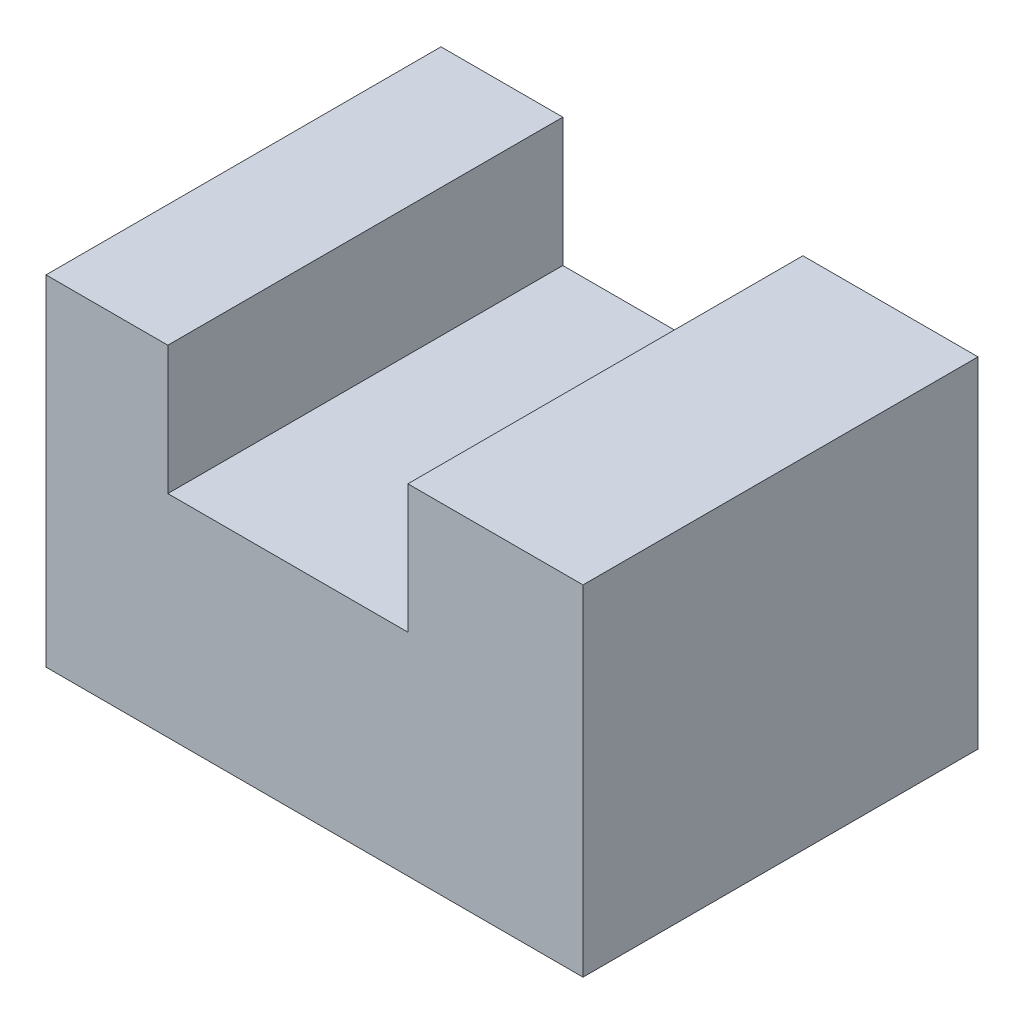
ISO-10303-21;
HEADER;
FILE_DESCRIPTION(('STEP AP214'),'2;1');
FILE_NAME('part.step','',(''),(''),'','','');
FILE_SCHEMA(('AUTOMOTIVE_DESIGN { 1 0 10303 214 1 1 1 1 }'));
ENDSEC;
DATA;
#1=APPLICATION_CONTEXT('core data for automotive mechanical design processes');
#2=APPLICATION_PROTOCOL_DEFINITION('international standard','automotive_design',2000,#1);
#3=PRODUCT_CONTEXT('',#1,'mechanical');
#4=PRODUCT('Part','Part','',(#3));
#5=PRODUCT_RELATED_PRODUCT_CATEGORY('part','',(#4));
#6=PRODUCT_DEFINITION_FORMATION('','',#4);
#7=PRODUCT_DEFINITION_CONTEXT('part definition',#1,'design');
#8=PRODUCT_DEFINITION('design','',#6,#7);
#9=PRODUCT_DEFINITION_SHAPE('','',#8);
#10=(LENGTH_UNIT() NAMED_UNIT(*) SI_UNIT(.MILLI.,.METRE.));
#11=(NAMED_UNIT(*) PLANE_ANGLE_UNIT() SI_UNIT($,.RADIAN.));
#12=(NAMED_UNIT(*) SI_UNIT($,.STERADIAN.) SOLID_ANGLE_UNIT());
#13=UNCERTAINTY_MEASURE_WITH_UNIT(LENGTH_MEASURE(1.E-05),#10,'distance_accuracy_value','');
#14=(GEOMETRIC_REPRESENTATION_CONTEXT(3) GLOBAL_UNCERTAINTY_ASSIGNED_CONTEXT((#13)) GLOBAL_UNIT_ASSIGNED_CONTEXT((#10,
#11,#12)) REPRESENTATION_CONTEXT('',''));
#15=CARTESIAN_POINT('',(0.,0.,0.));
#16=DIRECTION('',(0.,0.,1.));
#17=DIRECTION('',(1.,0.,0.));
#18=AXIS2_PLACEMENT_3D('',#15,#16,#17);
#19=CARTESIAN_POINT('',(0.,33.,0.));
#20=DIRECTION('',(0.,-1.,0.));
#21=DIRECTION('',(0.,0.,-1.));
#22=AXIS2_PLACEMENT_3D('',#19,#20,#21);
#23=PLANE('',#22);
#24=DIRECTION('',(1.,0.,0.));
#25=VECTOR('',#24,1.);
#26=CARTESIAN_POINT('',(1.39101041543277,33.,0.));
#27=LINE('',#26,#25);
#28=CARTESIAN_POINT('',(1.39101041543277,33.,0.));
#29=VERTEX_POINT('',#28);
#30=CARTESIAN_POINT('',(13.225196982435,33.,0.));
#31=VERTEX_POINT('',#30);
#32=EDGE_CURVE('E87',#29,#31,#27,.T.);
#33=ORIENTED_EDGE('',*,*,#32,.T.);
#34=DIRECTION('',(0.,0.,-1.));
#35=VECTOR('',#34,1.);
#36=CARTESIAN_POINT('',(13.225196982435,33.,0.));
#37=LINE('',#36,#35);
#38=CARTESIAN_POINT('',(13.225196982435,33.,-38.3687039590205));
#39=VERTEX_POINT('',#38);
#40=EDGE_CURVE('E41',#31,#39,#37,.T.);
#41=ORIENTED_EDGE('',*,*,#40,.T.);
#42=DIRECTION('',(-1.,0.,0.));
#43=VECTOR('',#42,1.);
#44=CARTESIAN_POINT('',(1.39101041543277,33.,-38.3687039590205));
#45=LINE('',#44,#43);
#46=CARTESIAN_POINT('',(1.39101041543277,33.,-38.3687039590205));
#47=VERTEX_POINT('',#46);
#48=EDGE_CURVE('E57',#39,#47,#45,.T.);
#49=ORIENTED_EDGE('',*,*,#48,.T.);
#50=DIRECTION('',(0.,0.,1.));
#51=VECTOR('',#50,1.);
#52=CARTESIAN_POINT('',(1.39101041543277,33.,0.));
#53=LINE('',#52,#51);
#54=EDGE_CURVE('E135',#47,#29,#53,.T.);
#55=ORIENTED_EDGE('',*,*,#54,.T.);
#56=EDGE_LOOP('',(#33,#41,#49,#55));
#57=FACE_BOUND('',#56,.T.);
#58=ADVANCED_FACE('F33',(#57),#23,.F.);
#59=CARTESIAN_POINT('',(1.39101041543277,33.,0.));
#60=DIRECTION('',(1.,0.,0.));
#61=DIRECTION('',(0.,0.,-1.));
#62=AXIS2_PLACEMENT_3D('',#59,#60,#61);
#63=PLANE('',#62);
#64=DIRECTION('',(0.,0.,1.));
#65=VECTOR('',#64,1.);
#66=CARTESIAN_POINT('',(1.39101041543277,0.,0.));
#67=LINE('',#66,#65);
#68=CARTESIAN_POINT('',(1.39101041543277,0.,-38.3687039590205));
#69=VERTEX_POINT('',#68);
#70=CARTESIAN_POINT('',(1.39101041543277,0.,0.));
#71=VERTEX_POINT('',#70);
#72=EDGE_CURVE('E134',#69,#71,#67,.T.);
#73=ORIENTED_EDGE('',*,*,#72,.T.);
#74=DIRECTION('',(0.,-1.,0.));
#75=VECTOR('',#74,1.);
#76=CARTESIAN_POINT('',(1.39101041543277,33.,0.));
#77=LINE('',#76,#75);
#78=EDGE_CURVE('E158',#29,#71,#77,.T.);
#79=ORIENTED_EDGE('',*,*,#78,.F.);
#80=ORIENTED_EDGE('',*,*,#54,.F.);
#81=DIRECTION('',(0.,-1.,0.));
#82=VECTOR('',#81,1.);
#83=CARTESIAN_POINT('',(1.39101041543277,33.,-38.3687039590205));
#84=LINE('',#83,#82);
#85=EDGE_CURVE('E144',#47,#69,#84,.T.);
#86=ORIENTED_EDGE('',*,*,#85,.T.);
#87=EDGE_LOOP('',(#73,#79,#80,#86));
#88=FACE_BOUND('',#87,.T.);
#89=ADVANCED_FACE('F35',(#88),#63,.F.);
#90=CARTESIAN_POINT('',(1.39101041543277,33.,0.));
#91=DIRECTION('',(0.,0.,-1.));
#92=DIRECTION('',(-1.,0.,0.));
#93=AXIS2_PLACEMENT_3D('',#90,#91,#92);
#94=PLANE('',#93);
#95=DIRECTION('',(1.,0.,0.));
#96=VECTOR('',#95,1.);
#97=CARTESIAN_POINT('',(13.225196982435,20.5189427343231,0.));
#98=LINE('',#97,#96);
#99=CARTESIAN_POINT('',(13.225196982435,20.5189427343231,0.));
#100=VERTEX_POINT('',#99);
#101=CARTESIAN_POINT('',(36.5436879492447,20.5189427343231,0.));
#102=VERTEX_POINT('',#101);
#103=EDGE_CURVE('E115',#100,#102,#98,.T.);
#104=ORIENTED_EDGE('',*,*,#103,.F.);
#105=DIRECTION('',(0.,-1.,0.));
#106=VECTOR('',#105,1.);
#107=CARTESIAN_POINT('',(13.225196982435,33.,0.));
#108=LINE('',#107,#106);
#109=EDGE_CURVE('E120',#31,#100,#108,.T.);
#110=ORIENTED_EDGE('',*,*,#109,.F.);
#111=ORIENTED_EDGE('',*,*,#32,.F.);
#112=ORIENTED_EDGE('',*,*,#78,.T.);
#113=DIRECTION('',(1.,0.,0.));
#114=VECTOR('',#113,1.);
#115=CARTESIAN_POINT('',(1.39101041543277,0.,0.));
#116=LINE('',#115,#114);
#117=CARTESIAN_POINT('',(53.5539009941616,0.,0.));
#118=VERTEX_POINT('',#117);
#119=EDGE_CURVE('E147',#71,#118,#116,.T.);
#120=ORIENTED_EDGE('',*,*,#119,.T.);
#121=DIRECTION('',(0.,-1.,0.));
#122=VECTOR('',#121,1.);
#123=CARTESIAN_POINT('',(53.5539009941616,33.,0.));
#124=LINE('',#123,#122);
#125=CARTESIAN_POINT('',(53.5539009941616,33.,0.));
#126=VERTEX_POINT('',#125);
#127=EDGE_CURVE('E155',#126,#118,#124,.T.);
#128=ORIENTED_EDGE('',*,*,#127,.F.);
#129=CARTESIAN_POINT('',(36.5436879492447,33.,0.));
#130=VERTEX_POINT('',#129);
#131=EDGE_CURVE('E137',#130,#126,#27,.T.);
#132=ORIENTED_EDGE('',*,*,#131,.F.);
#133=DIRECTION('',(0.,1.,0.));
#134=VECTOR('',#133,1.);
#135=CARTESIAN_POINT('',(36.5436879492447,33.,0.));
#136=LINE('',#135,#134);
#137=EDGE_CURVE('E48',#102,#130,#136,.T.);
#138=ORIENTED_EDGE('',*,*,#137,.F.);
#139=EDGE_LOOP('',(#104,#110,#111,#112,#120,#128,#132,#138));
#140=FACE_BOUND('',#139,.T.);
#141=ADVANCED_FACE('F123',(#140),#94,.F.);
#142=CARTESIAN_POINT('',(53.5539009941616,33.,0.));
#143=DIRECTION('',(-1.,0.,0.));
#144=DIRECTION('',(0.,0.,1.));
#145=AXIS2_PLACEMENT_3D('',#142,#143,#144);
#146=PLANE('',#145);
#147=DIRECTION('',(0.,0.,-1.));
#148=VECTOR('',#147,1.);
#149=CARTESIAN_POINT('',(53.5539009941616,0.,0.));
#150=LINE('',#149,#148);
#151=CARTESIAN_POINT('',(53.5539009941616,0.,-38.3687039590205));
#152=VERTEX_POINT('',#151);
#153=EDGE_CURVE('E149',#118,#152,#150,.T.);
#154=ORIENTED_EDGE('',*,*,#153,.T.);
#155=DIRECTION('',(0.,-1.,0.));
#156=VECTOR('',#155,1.);
#157=CARTESIAN_POINT('',(53.5539009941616,33.,-38.3687039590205));
#158=LINE('',#157,#156);
#159=CARTESIAN_POINT('',(53.5539009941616,33.,-38.3687039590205));
#160=VERTEX_POINT('',#159);
#161=EDGE_CURVE('E153',#160,#152,#158,.T.);
#162=ORIENTED_EDGE('',*,*,#161,.F.);
#163=DIRECTION('',(0.,0.,-1.));
#164=VECTOR('',#163,1.);
#165=CARTESIAN_POINT('',(53.5539009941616,33.,0.));
#166=LINE('',#165,#164);
#167=EDGE_CURVE('E139',#126,#160,#166,.T.);
#168=ORIENTED_EDGE('',*,*,#167,.F.);
#169=ORIENTED_EDGE('',*,*,#127,.T.);
#170=EDGE_LOOP('',(#154,#162,#168,#169));
#171=FACE_BOUND('',#170,.T.);
#172=ADVANCED_FACE('F171',(#171),#146,.F.);
#173=CARTESIAN_POINT('',(1.39101041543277,33.,-38.3687039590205));
#174=DIRECTION('',(0.,0.,1.));
#175=DIRECTION('',(1.,0.,0.));
#176=AXIS2_PLACEMENT_3D('',#173,#174,#175);
#177=PLANE('',#176);
#178=ORIENTED_EDGE('',*,*,#48,.F.);
#179=DIRECTION('',(0.,-1.,0.));
#180=VECTOR('',#179,1.);
#181=CARTESIAN_POINT('',(13.225196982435,33.,-38.3687039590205));
#182=LINE('',#181,#180);
#183=CARTESIAN_POINT('',(13.225196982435,20.5189427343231,-38.3687039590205));
#184=VERTEX_POINT('',#183);
#185=EDGE_CURVE('E132',#39,#184,#182,.T.);
#186=ORIENTED_EDGE('',*,*,#185,.T.);
#187=DIRECTION('',(1.,0.,0.));
#188=VECTOR('',#187,1.);
#189=CARTESIAN_POINT('',(1.39101041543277,20.5189427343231,-38.3687039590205));
#190=LINE('',#189,#188);
#191=CARTESIAN_POINT('',(36.5436879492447,20.5189427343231,-38.3687039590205));
#192=VERTEX_POINT('',#191);
#193=EDGE_CURVE('E11',#184,#192,#190,.T.);
#194=ORIENTED_EDGE('',*,*,#193,.T.);
#195=DIRECTION('',(0.,1.,0.));
#196=VECTOR('',#195,1.);
#197=CARTESIAN_POINT('',(36.5436879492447,33.,-38.3687039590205));
#198=LINE('',#197,#196);
#199=CARTESIAN_POINT('',(36.5436879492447,33.,-38.3687039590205));
#200=VERTEX_POINT('',#199);
#201=EDGE_CURVE('E128',#192,#200,#198,.T.);
#202=ORIENTED_EDGE('',*,*,#201,.T.);
#203=EDGE_CURVE('E141',#160,#200,#45,.T.);
#204=ORIENTED_EDGE('',*,*,#203,.F.);
#205=ORIENTED_EDGE('',*,*,#161,.T.);
#206=DIRECTION('',(-1.,0.,0.));
#207=VECTOR('',#206,1.);
#208=CARTESIAN_POINT('',(1.39101041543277,0.,-38.3687039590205));
#209=LINE('',#208,#207);
#210=EDGE_CURVE('E79',#152,#69,#209,.T.);
#211=ORIENTED_EDGE('',*,*,#210,.T.);
#212=ORIENTED_EDGE('',*,*,#85,.F.);
#213=EDGE_LOOP('',(#178,#186,#194,#202,#204,#205,#211,#212));
#214=FACE_BOUND('',#213,.T.);
#215=ADVANCED_FACE('F161',(#214),#177,.F.);
#216=ORIENTED_EDGE('',*,*,#203,.T.);
#217=DIRECTION('',(0.,0.,1.));
#218=VECTOR('',#217,1.);
#219=CARTESIAN_POINT('',(36.5436879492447,33.,0.));
#220=LINE('',#219,#218);
#221=EDGE_CURVE('E160',#200,#130,#220,.T.);
#222=ORIENTED_EDGE('',*,*,#221,.T.);
#223=ORIENTED_EDGE('',*,*,#131,.T.);
#224=ORIENTED_EDGE('',*,*,#167,.T.);
#225=EDGE_LOOP('',(#216,#222,#223,#224));
#226=FACE_BOUND('',#225,.T.);
#227=ADVANCED_FACE('F175',(#226),#23,.F.);
#228=CARTESIAN_POINT('',(0.,0.,0.));
#229=DIRECTION('',(0.,-1.,0.));
#230=DIRECTION('',(0.,0.,-1.));
#231=AXIS2_PLACEMENT_3D('',#228,#229,#230);
#232=PLANE('',#231);
#233=ORIENTED_EDGE('',*,*,#72,.F.);
#234=ORIENTED_EDGE('',*,*,#210,.F.);
#235=ORIENTED_EDGE('',*,*,#153,.F.);
#236=ORIENTED_EDGE('',*,*,#119,.F.);
#237=EDGE_LOOP('',(#233,#234,#235,#236));
#238=FACE_BOUND('',#237,.T.);
#239=ADVANCED_FACE('F173',(#238),#232,.T.);
#240=CARTESIAN_POINT('',(13.225196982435,20.5189427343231,-43.));
#241=DIRECTION('',(0.,-1.,0.));
#242=DIRECTION('',(0.,0.,-1.));
#243=AXIS2_PLACEMENT_3D('',#240,#241,#242);
#244=PLANE('',#243);
#245=DIRECTION('',(0.,0.,1.));
#246=VECTOR('',#245,1.);
#247=CARTESIAN_POINT('',(13.225196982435,20.5189427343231,-43.));
#248=LINE('',#247,#246);
#249=EDGE_CURVE('E110',#184,#100,#248,.T.);
#250=ORIENTED_EDGE('',*,*,#249,.T.);
#251=ORIENTED_EDGE('',*,*,#103,.T.);
#252=DIRECTION('',(0.,0.,1.));
#253=VECTOR('',#252,1.);
#254=CARTESIAN_POINT('',(36.5436879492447,20.5189427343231,-43.));
#255=LINE('',#254,#253);
#256=EDGE_CURVE('E118',#192,#102,#255,.T.);
#257=ORIENTED_EDGE('',*,*,#256,.F.);
#258=ORIENTED_EDGE('',*,*,#193,.F.);
#259=EDGE_LOOP('',(#250,#251,#257,#258));
#260=FACE_BOUND('',#259,.T.);
#261=ADVANCED_FACE('F112',(#260),#244,.F.);
#262=CARTESIAN_POINT('',(13.225196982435,33.,-43.));
#263=DIRECTION('',(-1.,0.,0.));
#264=DIRECTION('',(0.,0.,1.));
#265=AXIS2_PLACEMENT_3D('',#262,#263,#264);
#266=PLANE('',#265);
#267=ORIENTED_EDGE('',*,*,#40,.F.);
#268=ORIENTED_EDGE('',*,*,#109,.T.);
#269=ORIENTED_EDGE('',*,*,#249,.F.);
#270=ORIENTED_EDGE('',*,*,#185,.F.);
#271=EDGE_LOOP('',(#267,#268,#269,#270));
#272=FACE_BOUND('',#271,.T.);
#273=ADVANCED_FACE('F121',(#272),#266,.F.);
#274=CARTESIAN_POINT('',(36.5436879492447,33.,-43.));
#275=DIRECTION('',(1.,0.,0.));
#276=DIRECTION('',(0.,0.,-1.));
#277=AXIS2_PLACEMENT_3D('',#274,#275,#276);
#278=PLANE('',#277);
#279=ORIENTED_EDGE('',*,*,#256,.T.);
#280=ORIENTED_EDGE('',*,*,#137,.T.);
#281=ORIENTED_EDGE('',*,*,#221,.F.);
#282=ORIENTED_EDGE('',*,*,#201,.F.);
#283=EDGE_LOOP('',(#279,#280,#281,#282));
#284=FACE_BOUND('',#283,.T.);
#285=ADVANCED_FACE('F191',(#284),#278,.F.);
#286=CLOSED_SHELL('',(#58,#89,#141,#172,#215,#227,#239,#261,#273,#285));
#287=MANIFOLD_SOLID_BREP('B2',#286);
#288=ADVANCED_BREP_SHAPE_REPRESENTATION('',(#18,#287),#14);
#289=SHAPE_DEFINITION_REPRESENTATION(#9,#288);
ENDSEC;
END-ISO-10303-21;
